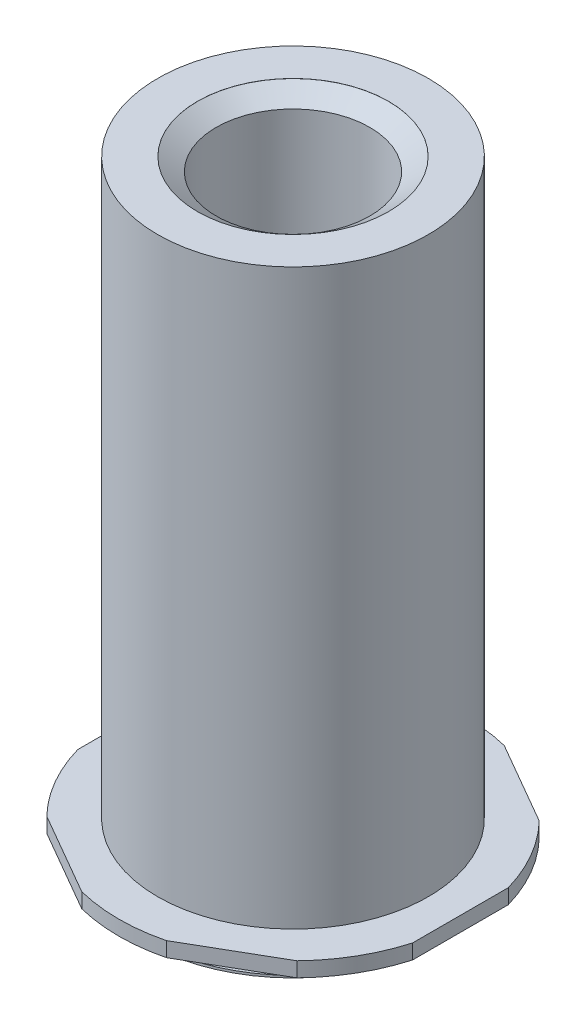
ISO-10303-21;
HEADER;
FILE_DESCRIPTION(('STEP AP214'),'2;1');
FILE_NAME('part.step','',(''),(''),'','','');
FILE_SCHEMA(('AUTOMOTIVE_DESIGN { 1 0 10303 214 1 1 1 1 }'));
ENDSEC;
DATA;
#1=APPLICATION_CONTEXT('core data for automotive mechanical design processes');
#2=APPLICATION_PROTOCOL_DEFINITION('international standard','automotive_design',2000,#1);
#3=PRODUCT_CONTEXT('',#1,'mechanical');
#4=PRODUCT('Part','Part','',(#3));
#5=PRODUCT_RELATED_PRODUCT_CATEGORY('part','',(#4));
#6=PRODUCT_DEFINITION_FORMATION('','',#4);
#7=PRODUCT_DEFINITION_CONTEXT('part definition',#1,'design');
#8=PRODUCT_DEFINITION('design','',#6,#7);
#9=PRODUCT_DEFINITION_SHAPE('','',#8);
#10=(LENGTH_UNIT() NAMED_UNIT(*) SI_UNIT(.MILLI.,.METRE.));
#11=(NAMED_UNIT(*) PLANE_ANGLE_UNIT() SI_UNIT($,.RADIAN.));
#12=(NAMED_UNIT(*) SI_UNIT($,.STERADIAN.) SOLID_ANGLE_UNIT());
#13=UNCERTAINTY_MEASURE_WITH_UNIT(LENGTH_MEASURE(1.E-05),#10,'distance_accuracy_value','');
#14=(GEOMETRIC_REPRESENTATION_CONTEXT(3) GLOBAL_UNCERTAINTY_ASSIGNED_CONTEXT((#13)) GLOBAL_UNIT_ASSIGNED_CONTEXT((#10,
#11,#12)) REPRESENTATION_CONTEXT('',''));
#15=CARTESIAN_POINT('',(0.,0.,0.));
#16=DIRECTION('',(0.,0.,1.));
#17=DIRECTION('',(1.,0.,0.));
#18=AXIS2_PLACEMENT_3D('',#15,#16,#17);
#19=CARTESIAN_POINT('',(0.,0.,0.));
#20=DIRECTION('',(0.,-1.,0.));
#21=DIRECTION('',(0.,0.,-1.));
#22=AXIS2_PLACEMENT_3D('',#19,#20,#21);
#23=CYLINDRICAL_SURFACE('',#22,5.785104);
#24=CARTESIAN_POINT('',(0.,0.,0.));
#25=DIRECTION('',(0.,-1.,0.));
#26=DIRECTION('',(0.,0.,-1.));
#27=AXIS2_PLACEMENT_3D('',#24,#25,#26);
#28=CIRCLE('',#27,5.785104);
#29=CARTESIAN_POINT('',(1.40518875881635,0.,5.61185110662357));
#30=VERTEX_POINT('',#29);
#31=CARTESIAN_POINT('',(-1.40518875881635,0.,5.61185110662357));
#32=VERTEX_POINT('',#31);
#33=EDGE_CURVE('E182',#30,#32,#28,.T.);
#34=ORIENTED_EDGE('',*,*,#33,.F.);
#35=DIRECTION('',(0.,-1.,0.));
#36=VECTOR('',#35,1.);
#37=CARTESIAN_POINT('',(1.40518875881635,0.,5.61185110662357));
#38=LINE('',#37,#36);
#39=CARTESIAN_POINT('',(1.40518875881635,0.49149,5.61185110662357));
#40=VERTEX_POINT('',#39);
#41=EDGE_CURVE('E255',#30,#40,#38,.F.);
#42=ORIENTED_EDGE('',*,*,#41,.T.);
#43=CARTESIAN_POINT('',(0.,0.49149,0.));
#44=DIRECTION('',(0.,-1.,0.));
#45=DIRECTION('',(0.,0.,-1.));
#46=AXIS2_PLACEMENT_3D('',#43,#44,#45);
#47=CIRCLE('',#46,5.785104);
#48=CARTESIAN_POINT('',(-1.40518875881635,0.49149,5.61185110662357));
#49=VERTEX_POINT('',#48);
#50=EDGE_CURVE('E150',#40,#49,#47,.T.);
#51=ORIENTED_EDGE('',*,*,#50,.T.);
#52=DIRECTION('',(0.,-1.,0.));
#53=VECTOR('',#52,1.);
#54=CARTESIAN_POINT('',(-1.40518875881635,0.,5.61185110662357));
#55=LINE('',#54,#53);
#56=EDGE_CURVE('E256',#49,#32,#55,.T.);
#57=ORIENTED_EDGE('',*,*,#56,.T.);
#58=EDGE_LOOP('',(#34,#42,#51,#57));
#59=FACE_BOUND('',#58,.T.);
#60=ADVANCED_FACE('F32',(#59),#23,.T.);
#61=CARTESIAN_POINT('',(5.5626,0.49149,1.58899639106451));
#62=VERTEX_POINT('',#61);
#63=CARTESIAN_POINT('',(4.15741124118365,0.49149,4.02285471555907));
#64=VERTEX_POINT('',#63);
#65=EDGE_CURVE('E141',#62,#64,#47,.T.);
#66=ORIENTED_EDGE('',*,*,#65,.T.);
#67=DIRECTION('',(0.,-1.,0.));
#68=VECTOR('',#67,1.);
#69=CARTESIAN_POINT('',(4.15741124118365,0.,4.02285471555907));
#70=LINE('',#69,#68);
#71=CARTESIAN_POINT('',(4.15741124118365,0.,4.02285471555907));
#72=VERTEX_POINT('',#71);
#73=EDGE_CURVE('E259',#64,#72,#70,.T.);
#74=ORIENTED_EDGE('',*,*,#73,.T.);
#75=CARTESIAN_POINT('',(5.5626,0.,1.58899639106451));
#76=VERTEX_POINT('',#75);
#77=EDGE_CURVE('E143',#76,#72,#28,.T.);
#78=ORIENTED_EDGE('',*,*,#77,.F.);
#79=DIRECTION('',(0.,-1.,0.));
#80=VECTOR('',#79,1.);
#81=CARTESIAN_POINT('',(5.5626,0.,1.58899639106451));
#82=LINE('',#81,#80);
#83=EDGE_CURVE('E125',#76,#62,#82,.F.);
#84=ORIENTED_EDGE('',*,*,#83,.T.);
#85=EDGE_LOOP('',(#66,#74,#78,#84));
#86=FACE_BOUND('',#85,.T.);
#87=ADVANCED_FACE('F139',(#86),#23,.T.);
#88=CARTESIAN_POINT('',(-4.15741124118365,0.,4.02285471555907));
#89=VERTEX_POINT('',#88);
#90=CARTESIAN_POINT('',(-5.5626,0.,1.58899639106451));
#91=VERTEX_POINT('',#90);
#92=EDGE_CURVE('E180',#89,#91,#28,.T.);
#93=ORIENTED_EDGE('',*,*,#92,.F.);
#94=DIRECTION('',(0.,-1.,0.));
#95=VECTOR('',#94,1.);
#96=CARTESIAN_POINT('',(-4.15741124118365,0.,4.02285471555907));
#97=LINE('',#96,#95);
#98=CARTESIAN_POINT('',(-4.15741124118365,0.49149,4.02285471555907));
#99=VERTEX_POINT('',#98);
#100=EDGE_CURVE('E190',#89,#99,#97,.F.);
#101=ORIENTED_EDGE('',*,*,#100,.T.);
#102=CARTESIAN_POINT('',(-5.5626,0.49149,1.5889963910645));
#103=VERTEX_POINT('',#102);
#104=EDGE_CURVE('E155',#99,#103,#47,.T.);
#105=ORIENTED_EDGE('',*,*,#104,.T.);
#106=DIRECTION('',(0.,-1.,0.));
#107=VECTOR('',#106,1.);
#108=CARTESIAN_POINT('',(-5.5626,0.,1.5889963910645));
#109=LINE('',#108,#107);
#110=EDGE_CURVE('E192',#103,#91,#109,.T.);
#111=ORIENTED_EDGE('',*,*,#110,.T.);
#112=EDGE_LOOP('',(#93,#101,#105,#111));
#113=FACE_BOUND('',#112,.T.);
#114=ADVANCED_FACE('F188',(#113),#23,.T.);
#115=CARTESIAN_POINT('',(-5.5626,0.,-1.58899639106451));
#116=VERTEX_POINT('',#115);
#117=CARTESIAN_POINT('',(-4.15741124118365,0.,-4.02285471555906));
#118=VERTEX_POINT('',#117);
#119=EDGE_CURVE('E193',#116,#118,#28,.T.);
#120=ORIENTED_EDGE('',*,*,#119,.F.);
#121=DIRECTION('',(0.,-1.,0.));
#122=VECTOR('',#121,1.);
#123=CARTESIAN_POINT('',(-5.5626,0.,-1.5889963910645));
#124=LINE('',#123,#122);
#125=CARTESIAN_POINT('',(-5.5626,0.49149,-1.5889963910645));
#126=VERTEX_POINT('',#125);
#127=EDGE_CURVE('E54',#116,#126,#124,.F.);
#128=ORIENTED_EDGE('',*,*,#127,.T.);
#129=CARTESIAN_POINT('',(-4.15741124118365,0.49149,-4.02285471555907));
#130=VERTEX_POINT('',#129);
#131=EDGE_CURVE('E159',#126,#130,#47,.T.);
#132=ORIENTED_EDGE('',*,*,#131,.T.);
#133=DIRECTION('',(0.,-1.,0.));
#134=VECTOR('',#133,1.);
#135=CARTESIAN_POINT('',(-4.15741124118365,0.,-4.02285471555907));
#136=LINE('',#135,#134);
#137=EDGE_CURVE('E452',#130,#118,#136,.T.);
#138=ORIENTED_EDGE('',*,*,#137,.T.);
#139=EDGE_LOOP('',(#120,#128,#132,#138));
#140=FACE_BOUND('',#139,.T.);
#141=ADVANCED_FACE('F247',(#140),#23,.T.);
#142=CARTESIAN_POINT('',(-1.40518875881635,0.,-5.61185110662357));
#143=VERTEX_POINT('',#142);
#144=CARTESIAN_POINT('',(1.40518875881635,0.,-5.61185110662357));
#145=VERTEX_POINT('',#144);
#146=EDGE_CURVE('E196',#143,#145,#28,.T.);
#147=ORIENTED_EDGE('',*,*,#146,.F.);
#148=DIRECTION('',(0.,-1.,0.));
#149=VECTOR('',#148,1.);
#150=CARTESIAN_POINT('',(-1.40518875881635,0.,-5.61185110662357));
#151=LINE('',#150,#149);
#152=CARTESIAN_POINT('',(-1.40518875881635,0.49149,-5.61185110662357));
#153=VERTEX_POINT('',#152);
#154=EDGE_CURVE('E46',#143,#153,#151,.F.);
#155=ORIENTED_EDGE('',*,*,#154,.T.);
#156=CARTESIAN_POINT('',(1.40518875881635,0.49149,-5.61185110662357));
#157=VERTEX_POINT('',#156);
#158=EDGE_CURVE('E153',#153,#157,#47,.T.);
#159=ORIENTED_EDGE('',*,*,#158,.T.);
#160=DIRECTION('',(0.,-1.,0.));
#161=VECTOR('',#160,1.);
#162=CARTESIAN_POINT('',(1.40518875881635,0.,-5.61185110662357));
#163=LINE('',#162,#161);
#164=EDGE_CURVE('E144',#157,#145,#163,.T.);
#165=ORIENTED_EDGE('',*,*,#164,.T.);
#166=EDGE_LOOP('',(#147,#155,#159,#165));
#167=FACE_BOUND('',#166,.T.);
#168=ADVANCED_FACE('F241',(#167),#23,.T.);
#169=CARTESIAN_POINT('',(4.15741124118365,0.,-4.02285471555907));
#170=VERTEX_POINT('',#169);
#171=CARTESIAN_POINT('',(5.5626,0.,-1.58899639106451));
#172=VERTEX_POINT('',#171);
#173=EDGE_CURVE('E200',#170,#172,#28,.T.);
#174=ORIENTED_EDGE('',*,*,#173,.F.);
#175=DIRECTION('',(0.,-1.,0.));
#176=VECTOR('',#175,1.);
#177=CARTESIAN_POINT('',(4.15741124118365,0.,-4.02285471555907));
#178=LINE('',#177,#176);
#179=CARTESIAN_POINT('',(4.15741124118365,0.49149,-4.02285471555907));
#180=VERTEX_POINT('',#179);
#181=EDGE_CURVE('E252',#170,#180,#178,.F.);
#182=ORIENTED_EDGE('',*,*,#181,.T.);
#183=CARTESIAN_POINT('',(5.5626,0.49149,-1.58899639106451));
#184=VERTEX_POINT('',#183);
#185=EDGE_CURVE('E149',#180,#184,#47,.T.);
#186=ORIENTED_EDGE('',*,*,#185,.T.);
#187=DIRECTION('',(0.,-1.,0.));
#188=VECTOR('',#187,1.);
#189=CARTESIAN_POINT('',(5.5626,0.,-1.58899639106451));
#190=LINE('',#189,#188);
#191=EDGE_CURVE('E128',#184,#172,#190,.T.);
#192=ORIENTED_EDGE('',*,*,#191,.T.);
#193=EDGE_LOOP('',(#174,#182,#186,#192));
#194=FACE_BOUND('',#193,.T.);
#195=ADVANCED_FACE('F236',(#194),#23,.T.);
#196=CARTESIAN_POINT('',(5.785104,0.49149,0.));
#197=DIRECTION('',(0.,1.,0.));
#198=DIRECTION('',(0.,0.,1.));
#199=AXIS2_PLACEMENT_3D('',#196,#197,#198);
#200=PLANE('',#199);
#201=CARTESIAN_POINT('',(0.,0.491490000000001,0.));
#202=DIRECTION('',(0.,-1.,0.));
#203=DIRECTION('',(0.,0.,-1.));
#204=AXIS2_PLACEMENT_3D('',#201,#202,#203);
#205=CIRCLE('',#204,4.4958);
#206=CARTESIAN_POINT('',(0.,0.491490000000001,-4.4958));
#207=VERTEX_POINT('',#206);
#208=EDGE_CURVE('E160',#207,#207,#205,.T.);
#209=ORIENTED_EDGE('',*,*,#208,.T.);
#210=EDGE_LOOP('',(#209));
#211=FACE_BOUND('',#210,.T.);
#212=ORIENTED_EDGE('',*,*,#50,.F.);
#213=DIRECTION('',(0.866025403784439,0.,-0.5));
#214=VECTOR('',#213,1.);
#215=CARTESIAN_POINT('',(5.5626,0.49149,3.21156860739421));
#216=LINE('',#215,#214);
#217=EDGE_CURVE('E134',#40,#64,#216,.T.);
#218=ORIENTED_EDGE('',*,*,#217,.T.);
#219=ORIENTED_EDGE('',*,*,#65,.F.);
#220=DIRECTION('',(0.,0.,-1.));
#221=VECTOR('',#220,1.);
#222=CARTESIAN_POINT('',(5.5626,0.49149,-3.21156860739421));
#223=LINE('',#222,#221);
#224=EDGE_CURVE('E122',#62,#184,#223,.T.);
#225=ORIENTED_EDGE('',*,*,#224,.T.);
#226=ORIENTED_EDGE('',*,*,#185,.F.);
#227=DIRECTION('',(-0.866025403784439,0.,-0.5));
#228=VECTOR('',#227,1.);
#229=CARTESIAN_POINT('',(0.,0.49149,-6.42313721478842));
#230=LINE('',#229,#228);
#231=EDGE_CURVE('E133',#180,#157,#230,.T.);
#232=ORIENTED_EDGE('',*,*,#231,.T.);
#233=ORIENTED_EDGE('',*,*,#158,.F.);
#234=DIRECTION('',(-0.866025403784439,0.,0.5));
#235=VECTOR('',#234,1.);
#236=CARTESIAN_POINT('',(-5.5626,0.49149,-3.21156860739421));
#237=LINE('',#236,#235);
#238=EDGE_CURVE('E465',#153,#130,#237,.T.);
#239=ORIENTED_EDGE('',*,*,#238,.T.);
#240=ORIENTED_EDGE('',*,*,#131,.F.);
#241=DIRECTION('',(0.,0.,1.));
#242=VECTOR('',#241,1.);
#243=CARTESIAN_POINT('',(-5.5626,0.49149,3.21156860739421));
#244=LINE('',#243,#242);
#245=EDGE_CURVE('E463',#126,#103,#244,.T.);
#246=ORIENTED_EDGE('',*,*,#245,.T.);
#247=ORIENTED_EDGE('',*,*,#104,.F.);
#248=DIRECTION('',(0.866025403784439,0.,0.5));
#249=VECTOR('',#248,1.);
#250=CARTESIAN_POINT('',(0.,0.49149,6.42313721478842));
#251=LINE('',#250,#249);
#252=EDGE_CURVE('E461',#99,#49,#251,.T.);
#253=ORIENTED_EDGE('',*,*,#252,.T.);
#254=EDGE_LOOP('',(#212,#218,#219,#225,#226,#232,#233,#239,#240,#246,#247,#253));
#255=FACE_BOUND('',#254,.T.);
#256=ADVANCED_FACE('F148',(#211,#255),#200,.T.);
#257=CARTESIAN_POINT('',(4.73206130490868,0.,0.));
#258=DIRECTION('',(0.,-1.,0.));
#259=DIRECTION('',(0.,0.,-1.));
#260=AXIS2_PLACEMENT_3D('',#257,#258,#259);
#261=PLANE('',#260);
#262=CARTESIAN_POINT('',(0.,0.,0.));
#263=DIRECTION('',(0.,-1.,0.));
#264=DIRECTION('',(0.,0.,-1.));
#265=AXIS2_PLACEMENT_3D('',#262,#263,#264);
#266=CIRCLE('',#265,4.73206130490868);
#267=CARTESIAN_POINT('',(0.,0.,-4.73206130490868));
#268=VERTEX_POINT('',#267);
#269=EDGE_CURVE('E202',#268,#268,#266,.T.);
#270=ORIENTED_EDGE('',*,*,#269,.F.);
#271=EDGE_LOOP('',(#270));
#272=FACE_BOUND('',#271,.T.);
#273=ORIENTED_EDGE('',*,*,#77,.T.);
#274=DIRECTION('',(-0.866025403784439,0.,0.5));
#275=VECTOR('',#274,1.);
#276=CARTESIAN_POINT('',(6.33034597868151,0.,2.76831025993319));
#277=LINE('',#276,#275);
#278=EDGE_CURVE('E11',#72,#30,#277,.T.);
#279=ORIENTED_EDGE('',*,*,#278,.T.);
#280=ORIENTED_EDGE('',*,*,#33,.T.);
#281=DIRECTION('',(-0.866025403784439,0.,-0.5));
#282=VECTOR('',#281,1.);
#283=CARTESIAN_POINT('',(0.767745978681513,0.,6.86639556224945));
#284=LINE('',#283,#282);
#285=EDGE_CURVE('E39',#32,#89,#284,.T.);
#286=ORIENTED_EDGE('',*,*,#285,.T.);
#287=ORIENTED_EDGE('',*,*,#92,.T.);
#288=DIRECTION('',(0.,0.,-1.));
#289=VECTOR('',#288,1.);
#290=CARTESIAN_POINT('',(-5.5626,0.,0.));
#291=LINE('',#290,#289);
#292=EDGE_CURVE('E173',#91,#116,#291,.T.);
#293=ORIENTED_EDGE('',*,*,#292,.T.);
#294=ORIENTED_EDGE('',*,*,#119,.T.);
#295=DIRECTION('',(0.866025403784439,0.,-0.5));
#296=VECTOR('',#295,1.);
#297=CARTESIAN_POINT('',(0.767745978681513,0.,-6.86639556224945));
#298=LINE('',#297,#296);
#299=EDGE_CURVE('E171',#118,#143,#298,.T.);
#300=ORIENTED_EDGE('',*,*,#299,.T.);
#301=ORIENTED_EDGE('',*,*,#146,.T.);
#302=DIRECTION('',(0.866025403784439,0.,0.5));
#303=VECTOR('',#302,1.);
#304=CARTESIAN_POINT('',(6.33034597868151,0.,-2.76831025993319));
#305=LINE('',#304,#303);
#306=EDGE_CURVE('E168',#145,#170,#305,.T.);
#307=ORIENTED_EDGE('',*,*,#306,.T.);
#308=ORIENTED_EDGE('',*,*,#173,.T.);
#309=DIRECTION('',(0.,0.,1.));
#310=VECTOR('',#309,1.);
#311=CARTESIAN_POINT('',(5.5626,0.,0.));
#312=LINE('',#311,#310);
#313=EDGE_CURVE('E152',#172,#76,#312,.T.);
#314=ORIENTED_EDGE('',*,*,#313,.T.);
#315=EDGE_LOOP('',(#273,#279,#280,#286,#287,#293,#294,#300,#301,#307,#308,#314));
#316=FACE_BOUND('',#315,.T.);
#317=ADVANCED_FACE('F179',(#272,#316),#261,.T.);
#318=CARTESIAN_POINT('',(0.,0.,0.));
#319=DIRECTION('',(0.,-1.,0.));
#320=DIRECTION('',(0.,0.,-1.));
#321=AXIS2_PLACEMENT_3D('',#318,#319,#320);
#322=CYLINDRICAL_SURFACE('',#321,4.4958);
#323=CARTESIAN_POINT('',(0.,19.54149,0.));
#324=DIRECTION('',(0.,-1.,0.));
#325=DIRECTION('',(0.,0.,-1.));
#326=AXIS2_PLACEMENT_3D('',#323,#324,#325);
#327=CIRCLE('',#326,4.4958);
#328=CARTESIAN_POINT('',(0.,19.54149,-4.4958));
#329=VERTEX_POINT('',#328);
#330=EDGE_CURVE('E213',#329,#329,#327,.T.);
#331=ORIENTED_EDGE('',*,*,#330,.T.);
#332=EDGE_LOOP('',(#331));
#333=FACE_BOUND('',#332,.T.);
#334=ORIENTED_EDGE('',*,*,#208,.F.);
#335=EDGE_LOOP('',(#334));
#336=FACE_BOUND('',#335,.T.);
#337=ADVANCED_FACE('F221',(#333,#336),#322,.T.);
#338=CARTESIAN_POINT('',(4.4958,19.54149,0.));
#339=DIRECTION('',(0.,1.,0.));
#340=DIRECTION('',(0.,0.,1.));
#341=AXIS2_PLACEMENT_3D('',#338,#339,#340);
#342=PLANE('',#341);
#343=CARTESIAN_POINT('',(0.,19.54149,0.));
#344=DIRECTION('',(0.,1.,0.));
#345=DIRECTION('',(0.,0.,1.));
#346=AXIS2_PLACEMENT_3D('',#343,#344,#345);
#347=CIRCLE('',#346,3.175);
#348=CARTESIAN_POINT('',(0.,19.54149,3.175));
#349=VERTEX_POINT('',#348);
#350=EDGE_CURVE('E162',#349,#349,#347,.T.);
#351=ORIENTED_EDGE('',*,*,#350,.F.);
#352=EDGE_LOOP('',(#351));
#353=FACE_BOUND('',#352,.T.);
#354=ORIENTED_EDGE('',*,*,#330,.F.);
#355=EDGE_LOOP('',(#354));
#356=FACE_BOUND('',#355,.T.);
#357=ADVANCED_FACE('F223',(#353,#356),#342,.T.);
#358=CARTESIAN_POINT('',(0.,-0.60071,0.));
#359=DIRECTION('',(0.,-1.,0.));
#360=DIRECTION('',(0.,0.,-1.));
#361=AXIS2_PLACEMENT_3D('',#358,#359,#360);
#362=PLANE('',#361);
#363=CARTESIAN_POINT('',(0.,-0.60071,0.));
#364=DIRECTION('',(0.,-1.,0.));
#365=DIRECTION('',(0.,0.,-1.));
#366=AXIS2_PLACEMENT_3D('',#363,#364,#365);
#367=CIRCLE('',#366,4.9403);
#368=CARTESIAN_POINT('',(0.,-0.60071,-4.9403));
#369=VERTEX_POINT('',#368);
#370=EDGE_CURVE('E211',#369,#369,#367,.T.);
#371=ORIENTED_EDGE('',*,*,#370,.T.);
#372=EDGE_LOOP('',(#371));
#373=FACE_BOUND('',#372,.T.);
#374=ADVANCED_FACE('F229',(#373),#362,.T.);
#375=CARTESIAN_POINT('',(0.,0.,0.));
#376=DIRECTION('',(0.,-1.,0.));
#377=DIRECTION('',(0.,0.,-1.));
#378=AXIS2_PLACEMENT_3D('',#375,#376,#377);
#379=CYLINDRICAL_SURFACE('',#378,4.9403);
#380=CARTESIAN_POINT('',(0.,-0.52451,0.));
#381=DIRECTION('',(0.,-1.,0.));
#382=DIRECTION('',(0.,0.,-1.));
#383=AXIS2_PLACEMENT_3D('',#380,#381,#382);
#384=CIRCLE('',#383,4.9403);
#385=CARTESIAN_POINT('',(0.,-0.52451,-4.9403));
#386=VERTEX_POINT('',#385);
#387=EDGE_CURVE('E208',#386,#386,#384,.T.);
#388=ORIENTED_EDGE('',*,*,#387,.T.);
#389=EDGE_LOOP('',(#388));
#390=FACE_BOUND('',#389,.T.);
#391=ORIENTED_EDGE('',*,*,#370,.F.);
#392=EDGE_LOOP('',(#391));
#393=FACE_BOUND('',#392,.T.);
#394=ADVANCED_FACE('F299',(#390,#393),#379,.T.);
#395=CARTESIAN_POINT('',(0.,-0.52451,0.));
#396=DIRECTION('',(0.,-1.,0.));
#397=DIRECTION('',(0.,0.,-1.));
#398=AXIS2_PLACEMENT_3D('',#395,#396,#397);
#399=CONICAL_SURFACE('',#398,4.9403,0.523598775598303);
#400=CARTESIAN_POINT('',(0.,-0.16383,0.));
#401=DIRECTION('',(0.,-1.,0.));
#402=DIRECTION('',(0.,0.,-1.));
#403=AXIS2_PLACEMENT_3D('',#400,#401,#402);
#404=CIRCLE('',#403,4.73206130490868);
#405=CARTESIAN_POINT('',(0.,-0.16383,-4.73206130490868));
#406=VERTEX_POINT('',#405);
#407=EDGE_CURVE('E205',#406,#406,#404,.T.);
#408=ORIENTED_EDGE('',*,*,#407,.T.);
#409=EDGE_LOOP('',(#408));
#410=FACE_BOUND('',#409,.T.);
#411=ORIENTED_EDGE('',*,*,#387,.F.);
#412=EDGE_LOOP('',(#411));
#413=FACE_BOUND('',#412,.T.);
#414=ADVANCED_FACE('F295',(#410,#413),#399,.T.);
#415=CARTESIAN_POINT('',(0.,0.,0.));
#416=DIRECTION('',(0.,-1.,0.));
#417=DIRECTION('',(0.,0.,-1.));
#418=AXIS2_PLACEMENT_3D('',#415,#416,#417);
#419=CYLINDRICAL_SURFACE('',#418,4.73206130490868);
#420=ORIENTED_EDGE('',*,*,#269,.T.);
#421=EDGE_LOOP('',(#420));
#422=FACE_BOUND('',#421,.T.);
#423=ORIENTED_EDGE('',*,*,#407,.F.);
#424=EDGE_LOOP('',(#423));
#425=FACE_BOUND('',#424,.T.);
#426=ADVANCED_FACE('F292',(#422,#425),#419,.T.);
#427=CARTESIAN_POINT('',(0.,-2.54,0.));
#428=DIRECTION('',(0.,-1.,0.));
#429=DIRECTION('',(0.,0.,-1.));
#430=AXIS2_PLACEMENT_3D('',#427,#428,#429);
#431=CYLINDRICAL_SURFACE('',#430,3.175);
#432=ORIENTED_EDGE('',*,*,#350,.T.);
#433=EDGE_LOOP('',(#432));
#434=FACE_BOUND('',#433,.T.);
#435=CARTESIAN_POINT('',(0.,19.53895,0.));
#436=DIRECTION('',(0.,-1.,0.));
#437=DIRECTION('',(0.,0.,-1.));
#438=AXIS2_PLACEMENT_3D('',#435,#436,#437);
#439=CIRCLE('',#438,3.175);
#440=CARTESIAN_POINT('',(0.,19.53895,-3.175));
#441=VERTEX_POINT('',#440);
#442=EDGE_CURVE('E266',#441,#441,#439,.T.);
#443=ORIENTED_EDGE('',*,*,#442,.T.);
#444=EDGE_LOOP('',(#443));
#445=FACE_BOUND('',#444,.T.);
#446=ADVANCED_FACE('F287',(#434,#445),#431,.F.);
#447=CARTESIAN_POINT('',(0.,19.1033726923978,0.));
#448=DIRECTION('',(0.,1.,0.));
#449=DIRECTION('',(0.,0.,1.));
#450=AXIS2_PLACEMENT_3D('',#447,#448,#449);
#451=CONICAL_SURFACE('',#450,2.5527,0.960105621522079);
#452=ORIENTED_EDGE('',*,*,#442,.F.);
#453=EDGE_LOOP('',(#452));
#454=FACE_BOUND('',#453,.T.);
#455=CARTESIAN_POINT('',(0.,19.1033726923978,0.));
#456=DIRECTION('',(0.,-1.,0.));
#457=DIRECTION('',(0.,0.,-1.));
#458=AXIS2_PLACEMENT_3D('',#455,#456,#457);
#459=CIRCLE('',#458,2.5527);
#460=CARTESIAN_POINT('',(0.,19.1033726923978,-2.5527));
#461=VERTEX_POINT('',#460);
#462=EDGE_CURVE('E166',#461,#461,#459,.T.);
#463=ORIENTED_EDGE('',*,*,#462,.T.);
#464=EDGE_LOOP('',(#463));
#465=FACE_BOUND('',#464,.T.);
#466=ADVANCED_FACE('F271',(#454,#465),#451,.F.);
#467=CARTESIAN_POINT('',(0.,2.6091270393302,0.));
#468=DIRECTION('',(0.,1.,0.));
#469=DIRECTION('',(0.,0.,1.));
#470=AXIS2_PLACEMENT_3D('',#467,#468,#469);
#471=CONICAL_SURFACE('',#470,0.,1.17809724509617);
#472=CARTESIAN_POINT('',(0.,3.66649,0.));
#473=DIRECTION('',(0.,-1.,0.));
#474=DIRECTION('',(0.,0.,-1.));
#475=AXIS2_PLACEMENT_3D('',#472,#473,#474);
#476=CIRCLE('',#475,2.5527);
#477=CARTESIAN_POINT('',(0.,3.66649,-2.5527));
#478=VERTEX_POINT('',#477);
#479=EDGE_CURVE('E165',#478,#478,#476,.T.);
#480=ORIENTED_EDGE('',*,*,#479,.F.);
#481=EDGE_LOOP('',(#480));
#482=FACE_BOUND('',#481,.T.);
#483=CARTESIAN_POINT('',(0.,2.6091270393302,0.));
#484=VERTEX_POINT('',#483);
#485=VERTEX_LOOP('',#484);
#486=FACE_BOUND('',#485,.T.);
#487=ADVANCED_FACE('F276',(#482,#486),#471,.F.);
#488=CARTESIAN_POINT('',(0.,0.,0.));
#489=DIRECTION('',(0.,-1.,0.));
#490=DIRECTION('',(0.,0.,-1.));
#491=AXIS2_PLACEMENT_3D('',#488,#489,#490);
#492=CYLINDRICAL_SURFACE('',#491,2.5527);
#493=ORIENTED_EDGE('',*,*,#462,.F.);
#494=EDGE_LOOP('',(#493));
#495=FACE_BOUND('',#494,.T.);
#496=ORIENTED_EDGE('',*,*,#479,.T.);
#497=EDGE_LOOP('',(#496));
#498=FACE_BOUND('',#497,.T.);
#499=ADVANCED_FACE('F273',(#495,#498),#492,.F.);
#500=CARTESIAN_POINT('',(5.5626,0.,-3.21156860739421));
#501=DIRECTION('',(1.,0.,0.));
#502=DIRECTION('',(0.,0.,-1.));
#503=AXIS2_PLACEMENT_3D('',#500,#501,#502);
#504=PLANE('',#503);
#505=ORIENTED_EDGE('',*,*,#313,.F.);
#506=ORIENTED_EDGE('',*,*,#191,.F.);
#507=ORIENTED_EDGE('',*,*,#224,.F.);
#508=ORIENTED_EDGE('',*,*,#83,.F.);
#509=EDGE_LOOP('',(#505,#506,#507,#508));
#510=FACE_BOUND('',#509,.T.);
#511=ADVANCED_FACE('F124',(#510),#504,.T.);
#512=CARTESIAN_POINT('',(0.,0.,-6.42313721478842));
#513=DIRECTION('',(0.5,0.,-0.866025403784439));
#514=DIRECTION('',(-0.866025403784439,0.,-0.5));
#515=AXIS2_PLACEMENT_3D('',#512,#513,#514);
#516=PLANE('',#515);
#517=ORIENTED_EDGE('',*,*,#306,.F.);
#518=ORIENTED_EDGE('',*,*,#164,.F.);
#519=ORIENTED_EDGE('',*,*,#231,.F.);
#520=ORIENTED_EDGE('',*,*,#181,.F.);
#521=EDGE_LOOP('',(#517,#518,#519,#520));
#522=FACE_BOUND('',#521,.T.);
#523=ADVANCED_FACE('F398',(#522),#516,.T.);
#524=CARTESIAN_POINT('',(-5.5626,0.,-3.21156860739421));
#525=DIRECTION('',(-0.5,0.,-0.866025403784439));
#526=DIRECTION('',(-0.866025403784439,0.,0.5));
#527=AXIS2_PLACEMENT_3D('',#524,#525,#526);
#528=PLANE('',#527);
#529=ORIENTED_EDGE('',*,*,#299,.F.);
#530=ORIENTED_EDGE('',*,*,#137,.F.);
#531=ORIENTED_EDGE('',*,*,#238,.F.);
#532=ORIENTED_EDGE('',*,*,#154,.F.);
#533=EDGE_LOOP('',(#529,#530,#531,#532));
#534=FACE_BOUND('',#533,.T.);
#535=ADVANCED_FACE('F407',(#534),#528,.T.);
#536=CARTESIAN_POINT('',(-5.5626,0.,3.21156860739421));
#537=DIRECTION('',(-1.,0.,0.));
#538=DIRECTION('',(0.,0.,1.));
#539=AXIS2_PLACEMENT_3D('',#536,#537,#538);
#540=PLANE('',#539);
#541=ORIENTED_EDGE('',*,*,#292,.F.);
#542=ORIENTED_EDGE('',*,*,#110,.F.);
#543=ORIENTED_EDGE('',*,*,#245,.F.);
#544=ORIENTED_EDGE('',*,*,#127,.F.);
#545=EDGE_LOOP('',(#541,#542,#543,#544));
#546=FACE_BOUND('',#545,.T.);
#547=ADVANCED_FACE('F417',(#546),#540,.T.);
#548=CARTESIAN_POINT('',(0.,0.,6.42313721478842));
#549=DIRECTION('',(-0.5,0.,0.866025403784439));
#550=DIRECTION('',(0.866025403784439,0.,0.5));
#551=AXIS2_PLACEMENT_3D('',#548,#549,#550);
#552=PLANE('',#551);
#553=ORIENTED_EDGE('',*,*,#285,.F.);
#554=ORIENTED_EDGE('',*,*,#56,.F.);
#555=ORIENTED_EDGE('',*,*,#252,.F.);
#556=ORIENTED_EDGE('',*,*,#100,.F.);
#557=EDGE_LOOP('',(#553,#554,#555,#556));
#558=FACE_BOUND('',#557,.T.);
#559=ADVANCED_FACE('F426',(#558),#552,.T.);
#560=CARTESIAN_POINT('',(5.5626,0.,3.21156860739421));
#561=DIRECTION('',(0.5,0.,0.866025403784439));
#562=DIRECTION('',(0.866025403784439,0.,-0.5));
#563=AXIS2_PLACEMENT_3D('',#560,#561,#562);
#564=PLANE('',#563);
#565=ORIENTED_EDGE('',*,*,#278,.F.);
#566=ORIENTED_EDGE('',*,*,#73,.F.);
#567=ORIENTED_EDGE('',*,*,#217,.F.);
#568=ORIENTED_EDGE('',*,*,#41,.F.);
#569=EDGE_LOOP('',(#565,#566,#567,#568));
#570=FACE_BOUND('',#569,.T.);
#571=ADVANCED_FACE('F435',(#570),#564,.T.);
#572=CLOSED_SHELL('',(#60,#87,#114,#141,#168,#195,#256,#317,#337,#357,#374,#394,#414,#426,#446,
#466,#487,#499,#511,#523,#535,#547,#559,#571));
#573=MANIFOLD_SOLID_BREP('B2',#572);
#574=ADVANCED_BREP_SHAPE_REPRESENTATION('',(#18,#573),#14);
#575=SHAPE_DEFINITION_REPRESENTATION(#9,#574);
ENDSEC;
END-ISO-10303-21;
